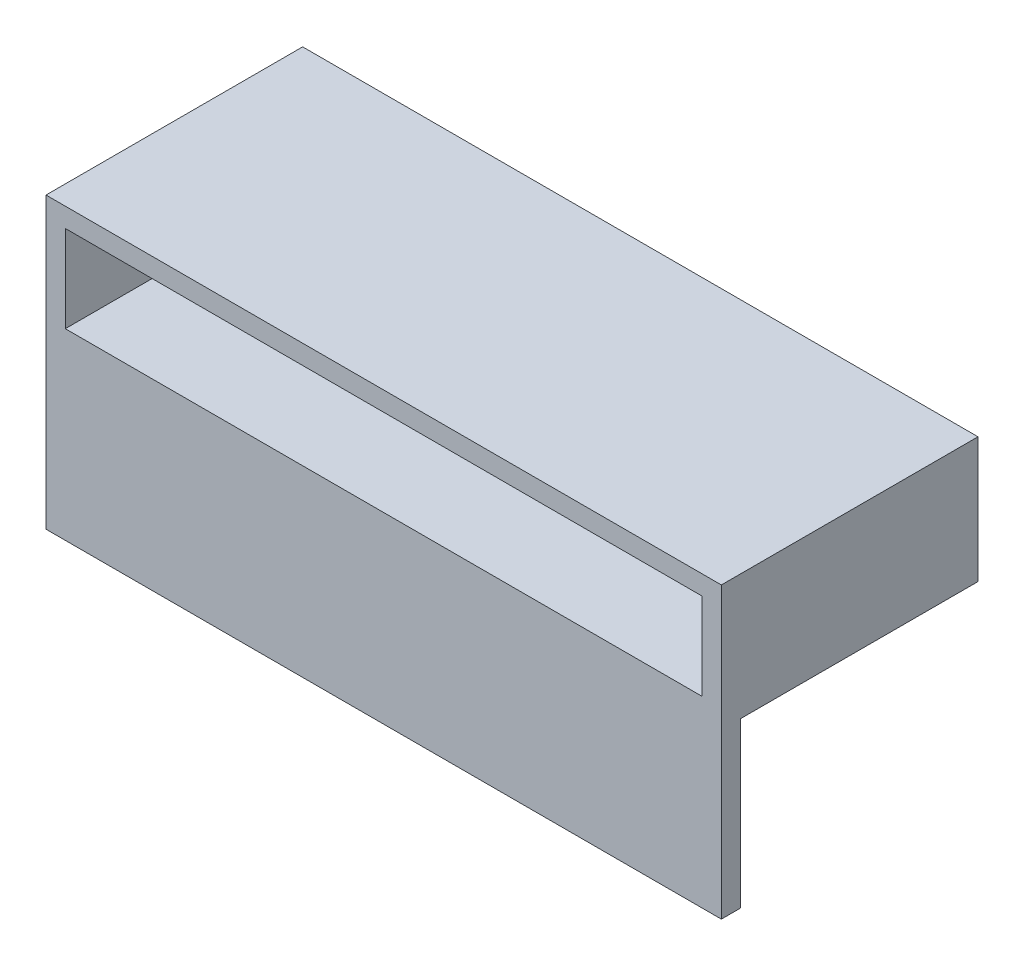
from build123d import *

# Parameters (mm, degrees)
SKETCH_1_W          = 70
SKETCH_1_H          = 30
EXTRUDE_374_DEPTH   = 2
SKETCH_2_W          = 70
SKETCH_2_H          = 13
EXTRUDE_1_DEPTH     = 24.6
SKETCH_3_W          = 66
SKETCH_3_H          = 9
CUT_EXTRUDE_1_DEPTH = 24.6


with BuildPart() as part:
    # Sketch 1 → Extrude 374 (new body)
    with BuildSketch(Plane.XY):
        with Locations((0, 15)):
            Rectangle(SKETCH_1_W, SKETCH_1_H)
    extrude(amount=EXTRUDE_374_DEPTH)

    # Sketch 2 → Extrude 1 (add)
    with BuildSketch(Plane(origin=(0, 0, 0), x_dir=(-1, 0, 0), z_dir=(0, 0, -1))):
        with Locations((0, 23.5)):
            Rectangle(SKETCH_2_W, SKETCH_2_H)
    extrude(amount=EXTRUDE_1_DEPTH)

    # Sketch 3 → Cut-Extrude 1 (cut)
    with BuildSketch(Plane.XY.offset(2)):
        with Locations((0, 23.5)):
            Rectangle(SKETCH_3_W, SKETCH_3_H)
    extrude(amount=-CUT_EXTRUDE_1_DEPTH, mode=Mode.SUBTRACT)


solid = part.part
